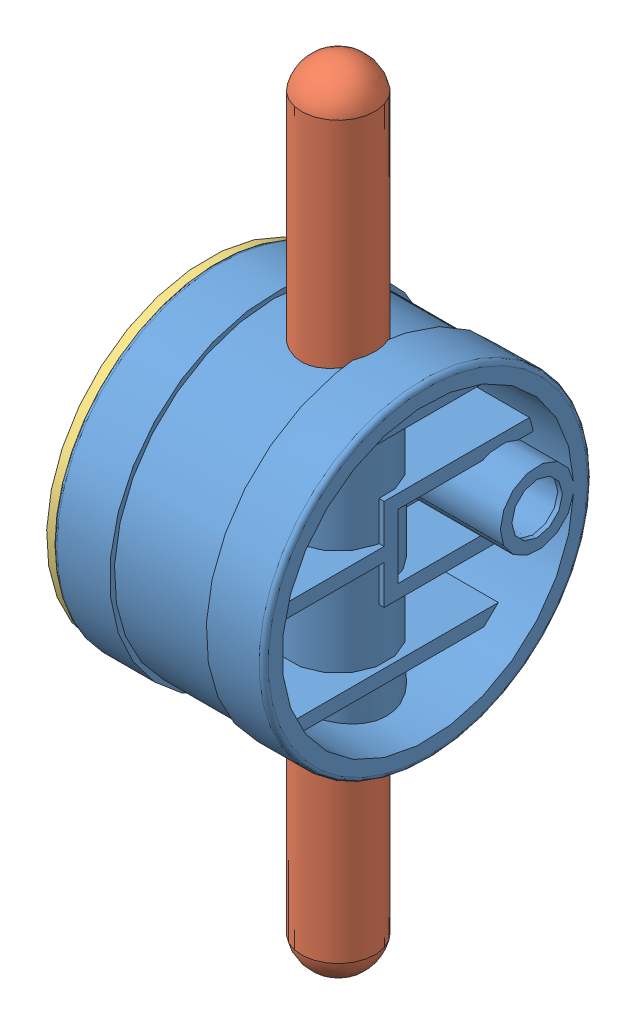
SolidWorks assembly Roulement+axe.SLDASM, configuration Défaut (file format 11000). Lengths in mm.
Overall size (48 171.97 98.78).
3 component instances, 3 part files, 4 mates.
Components (placement in the parent):
- Roulement_plastic_7-3: Roulement_plastic_7.sldprt [Défaut] at origin size (46 71.5 71.5)
- Axe_10-1: Axe_10.sldprt [Défaut] at (0 7.5 0) x (-0.541803 0 -0.840505) z (0 -1 0) size (16 16 171.97)
- Rondelle_roulement-1: Rondelle_roulement.sldprt [Défaut] at (-26.5 0 0) x (0 -0.752418 -0.658686) z (-1 0 0) size (70 70 2)
Mates (geometry in assembly coordinates):
- Coaxiale1: concentric: cylinder of Roulement_plastic_7-3 through (0 -35.167 0) axis (0 1 0) radius 8; cylinder of Axe_10-1 through (0 -3 0) axis (0 -1 0) radius 8
- Tangent1: tangent: cylinder of assembly through (-7.3137 0 0) axis (-1 0 0) radius 3
- Coïncidente1: coincident: plane of Roulement_plastic_7-3 through (-26.5 -35.288 -35.167) normal (-1 0 0); plane of Rondelle_roulement-1 through (-26.5 50.0616 -3.4117) normal (1 0 0)
- Coaxiale2: concentric: cylinder of Roulement_plastic_7-3 through (-25.5 0 0) axis (1 0 0) radius 35.75; cylinder of Rondelle_roulement-1 through (-28.5 0 0) axis (1 0 0) radius 35
